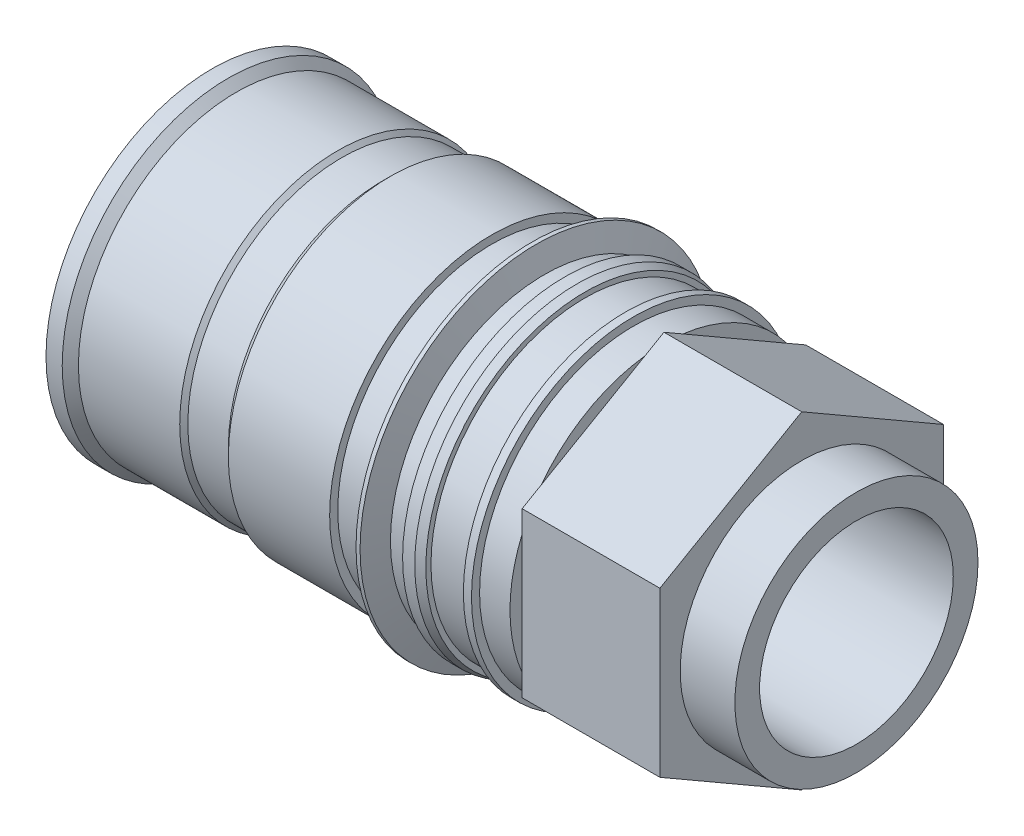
ISO-10303-21;
HEADER;
FILE_DESCRIPTION(('STEP AP214'),'2;1');
FILE_NAME('part.step','',(''),(''),'','','');
FILE_SCHEMA(('AUTOMOTIVE_DESIGN { 1 0 10303 214 1 1 1 1 }'));
ENDSEC;
DATA;
#1=APPLICATION_CONTEXT('core data for automotive mechanical design processes');
#2=APPLICATION_PROTOCOL_DEFINITION('international standard','automotive_design',2000,#1);
#3=PRODUCT_CONTEXT('',#1,'mechanical');
#4=PRODUCT('Part','Part','',(#3));
#5=PRODUCT_RELATED_PRODUCT_CATEGORY('part','',(#4));
#6=PRODUCT_DEFINITION_FORMATION('','',#4);
#7=PRODUCT_DEFINITION_CONTEXT('part definition',#1,'design');
#8=PRODUCT_DEFINITION('design','',#6,#7);
#9=PRODUCT_DEFINITION_SHAPE('','',#8);
#10=(LENGTH_UNIT() NAMED_UNIT(*) SI_UNIT(.MILLI.,.METRE.));
#11=(NAMED_UNIT(*) PLANE_ANGLE_UNIT() SI_UNIT($,.RADIAN.));
#12=(NAMED_UNIT(*) SI_UNIT($,.STERADIAN.) SOLID_ANGLE_UNIT());
#13=UNCERTAINTY_MEASURE_WITH_UNIT(LENGTH_MEASURE(1.E-05),#10,'distance_accuracy_value','');
#14=(GEOMETRIC_REPRESENTATION_CONTEXT(3) GLOBAL_UNCERTAINTY_ASSIGNED_CONTEXT((#13)) GLOBAL_UNIT_ASSIGNED_CONTEXT((#10,
#11,#12)) REPRESENTATION_CONTEXT('',''));
#15=CARTESIAN_POINT('',(0.,0.,0.));
#16=DIRECTION('',(0.,0.,1.));
#17=DIRECTION('',(1.,0.,0.));
#18=AXIS2_PLACEMENT_3D('',#15,#16,#17);
#19=CARTESIAN_POINT('',(111.5,38.,0.));
#20=DIRECTION('',(-1.,0.,0.));
#21=DIRECTION('',(0.,0.,1.));
#22=AXIS2_PLACEMENT_3D('',#19,#20,#21);
#23=PLANE('',#22);
#24=DIRECTION('',(0.,0.5,0.866025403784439));
#25=VECTOR('',#24,1.);
#26=CARTESIAN_POINT('',(111.5,20.2072594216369,-35.));
#27=LINE('',#26,#25);
#28=CARTESIAN_POINT('',(111.5,22.911564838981,-30.3160056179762));
#29=VERTEX_POINT('',#28);
#30=CARTESIAN_POINT('',(111.5,37.7102134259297,-4.68399438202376));
#31=VERTEX_POINT('',#30);
#32=EDGE_CURVE('E41',#29,#31,#27,.T.);
#33=ORIENTED_EDGE('',*,*,#32,.F.);
#34=CARTESIAN_POINT('',(111.5,0.,0.));
#35=DIRECTION('',(-1.,0.,0.));
#36=DIRECTION('',(0.,0.,1.));
#37=AXIS2_PLACEMENT_3D('',#34,#35,#36);
#38=CIRCLE('',#37,38.);
#39=EDGE_CURVE('E296',#31,#29,#38,.T.);
#40=ORIENTED_EDGE('',*,*,#39,.F.);
#41=EDGE_LOOP('',(#33,#40));
#42=FACE_BOUND('',#41,.T.);
#43=ADVANCED_FACE('F32',(#42),#23,.F.);
#44=DIRECTION('',(0.,1.,0.));
#45=VECTOR('',#44,1.);
#46=CARTESIAN_POINT('',(111.5,-20.2072594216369,-35.));
#47=LINE('',#46,#45);
#48=CARTESIAN_POINT('',(111.5,-14.7986485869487,-35.));
#49=VERTEX_POINT('',#48);
#50=CARTESIAN_POINT('',(111.5,14.7986485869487,-35.));
#51=VERTEX_POINT('',#50);
#52=EDGE_CURVE('E242',#49,#51,#47,.T.);
#53=ORIENTED_EDGE('',*,*,#52,.F.);
#54=EDGE_CURVE('E290',#51,#49,#38,.T.);
#55=ORIENTED_EDGE('',*,*,#54,.F.);
#56=EDGE_LOOP('',(#53,#55));
#57=FACE_BOUND('',#56,.T.);
#58=ADVANCED_FACE('F323',(#57),#23,.F.);
#59=DIRECTION('',(0.,0.5,-0.866025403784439));
#60=VECTOR('',#59,1.);
#61=CARTESIAN_POINT('',(111.5,-40.4145188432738,0.));
#62=LINE('',#61,#60);
#63=CARTESIAN_POINT('',(111.5,-37.7102134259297,-4.68399438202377));
#64=VERTEX_POINT('',#63);
#65=CARTESIAN_POINT('',(111.5,-22.911564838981,-30.3160056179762));
#66=VERTEX_POINT('',#65);
#67=EDGE_CURVE('E244',#64,#66,#62,.T.);
#68=ORIENTED_EDGE('',*,*,#67,.F.);
#69=EDGE_CURVE('E284',#66,#64,#38,.T.);
#70=ORIENTED_EDGE('',*,*,#69,.F.);
#71=EDGE_LOOP('',(#68,#70));
#72=FACE_BOUND('',#71,.T.);
#73=ADVANCED_FACE('F330',(#72),#23,.F.);
#74=DIRECTION('',(0.,-0.5,-0.866025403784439));
#75=VECTOR('',#74,1.);
#76=CARTESIAN_POINT('',(111.5,-20.2072594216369,35.));
#77=LINE('',#76,#75);
#78=CARTESIAN_POINT('',(111.5,-22.911564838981,30.3160056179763));
#79=VERTEX_POINT('',#78);
#80=CARTESIAN_POINT('',(111.5,-37.7102134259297,4.68399438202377));
#81=VERTEX_POINT('',#80);
#82=EDGE_CURVE('E55',#79,#81,#77,.T.);
#83=ORIENTED_EDGE('',*,*,#82,.F.);
#84=EDGE_CURVE('E281',#81,#79,#38,.T.);
#85=ORIENTED_EDGE('',*,*,#84,.F.);
#86=EDGE_LOOP('',(#83,#85));
#87=FACE_BOUND('',#86,.T.);
#88=ADVANCED_FACE('F342',(#87),#23,.F.);
#89=DIRECTION('',(0.,-1.,0.));
#90=VECTOR('',#89,1.);
#91=CARTESIAN_POINT('',(111.5,20.2072594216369,35.));
#92=LINE('',#91,#90);
#93=CARTESIAN_POINT('',(111.5,14.7986485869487,35.));
#94=VERTEX_POINT('',#93);
#95=CARTESIAN_POINT('',(111.5,-14.7986485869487,35.));
#96=VERTEX_POINT('',#95);
#97=EDGE_CURVE('E228',#94,#96,#92,.T.);
#98=ORIENTED_EDGE('',*,*,#97,.F.);
#99=EDGE_CURVE('E48',#96,#94,#38,.T.);
#100=ORIENTED_EDGE('',*,*,#99,.F.);
#101=EDGE_LOOP('',(#98,#100));
#102=FACE_BOUND('',#101,.T.);
#103=ADVANCED_FACE('F335',(#102),#23,.F.);
#104=DIRECTION('',(0.,-0.5,0.866025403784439));
#105=VECTOR('',#104,1.);
#106=CARTESIAN_POINT('',(111.5,40.4145188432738,0.));
#107=LINE('',#106,#105);
#108=CARTESIAN_POINT('',(111.5,37.7102134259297,4.68399438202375));
#109=VERTEX_POINT('',#108);
#110=CARTESIAN_POINT('',(111.5,22.911564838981,30.3160056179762));
#111=VERTEX_POINT('',#110);
#112=EDGE_CURVE('E224',#109,#111,#107,.T.);
#113=ORIENTED_EDGE('',*,*,#112,.F.);
#114=EDGE_CURVE('E160',#111,#109,#38,.T.);
#115=ORIENTED_EDGE('',*,*,#114,.F.);
#116=EDGE_LOOP('',(#113,#115));
#117=FACE_BOUND('',#116,.T.);
#118=ADVANCED_FACE('F326',(#117),#23,.F.);
#119=CARTESIAN_POINT('',(0.,0.,0.));
#120=DIRECTION('',(1.,0.,0.));
#121=DIRECTION('',(0.,0.,-1.));
#122=AXIS2_PLACEMENT_3D('',#119,#120,#121);
#123=PLANE('',#122);
#124=CARTESIAN_POINT('',(0.,0.,0.));
#125=DIRECTION('',(1.,0.,0.));
#126=DIRECTION('',(0.,0.,-1.));
#127=AXIS2_PLACEMENT_3D('',#124,#125,#126);
#128=CIRCLE('',#127,23.9);
#129=CARTESIAN_POINT('',(0.,0.,-23.9));
#130=VERTEX_POINT('',#129);
#131=EDGE_CURVE('E397',#130,#130,#128,.T.);
#132=ORIENTED_EDGE('',*,*,#131,.T.);
#133=EDGE_LOOP('',(#132));
#134=FACE_BOUND('',#133,.T.);
#135=CARTESIAN_POINT('',(0.,0.,0.));
#136=DIRECTION('',(-1.,0.,0.));
#137=DIRECTION('',(0.,0.,1.));
#138=AXIS2_PLACEMENT_3D('',#135,#136,#137);
#139=CIRCLE('',#138,41.);
#140=CARTESIAN_POINT('',(0.,0.,41.));
#141=VERTEX_POINT('',#140);
#142=EDGE_CURVE('E36',#141,#141,#139,.T.);
#143=ORIENTED_EDGE('',*,*,#142,.T.);
#144=EDGE_LOOP('',(#143));
#145=FACE_BOUND('',#144,.T.);
#146=ADVANCED_FACE('F34',(#134,#145),#123,.F.);
#147=CARTESIAN_POINT('',(0.,0.,0.));
#148=DIRECTION('',(-1.,0.,0.));
#149=DIRECTION('',(0.,0.,1.));
#150=AXIS2_PLACEMENT_3D('',#147,#148,#149);
#151=CYLINDRICAL_SURFACE('',#150,41.);
#152=ORIENTED_EDGE('',*,*,#142,.F.);
#153=EDGE_LOOP('',(#152));
#154=FACE_BOUND('',#153,.T.);
#155=CARTESIAN_POINT('',(4.,0.,0.));
#156=DIRECTION('',(-1.,0.,0.));
#157=DIRECTION('',(0.,0.,1.));
#158=AXIS2_PLACEMENT_3D('',#155,#156,#157);
#159=CIRCLE('',#158,41.);
#160=CARTESIAN_POINT('',(4.,0.,41.));
#161=VERTEX_POINT('',#160);
#162=EDGE_CURVE('E219',#161,#161,#159,.T.);
#163=ORIENTED_EDGE('',*,*,#162,.T.);
#164=EDGE_LOOP('',(#163));
#165=FACE_BOUND('',#164,.T.);
#166=ADVANCED_FACE('F340',(#154,#165),#151,.T.);
#167=CARTESIAN_POINT('',(6.,0.,0.));
#168=DIRECTION('',(-1.,0.,0.));
#169=DIRECTION('',(0.,0.,1.));
#170=AXIS2_PLACEMENT_3D('',#167,#168,#169);
#171=CONICAL_SURFACE('',#170,39.,0.78539816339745);
#172=ORIENTED_EDGE('',*,*,#162,.F.);
#173=EDGE_LOOP('',(#172));
#174=FACE_BOUND('',#173,.T.);
#175=CARTESIAN_POINT('',(6.,0.,0.));
#176=DIRECTION('',(-1.,0.,0.));
#177=DIRECTION('',(0.,0.,1.));
#178=AXIS2_PLACEMENT_3D('',#175,#176,#177);
#179=CIRCLE('',#178,39.);
#180=CARTESIAN_POINT('',(6.,0.,39.));
#181=VERTEX_POINT('',#180);
#182=EDGE_CURVE('E217',#181,#181,#179,.T.);
#183=ORIENTED_EDGE('',*,*,#182,.T.);
#184=EDGE_LOOP('',(#183));
#185=FACE_BOUND('',#184,.T.);
#186=ADVANCED_FACE('F439',(#174,#185),#171,.T.);
#187=CARTESIAN_POINT('',(0.,0.,0.));
#188=DIRECTION('',(-1.,0.,0.));
#189=DIRECTION('',(0.,0.,1.));
#190=AXIS2_PLACEMENT_3D('',#187,#188,#189);
#191=CYLINDRICAL_SURFACE('',#190,39.);
#192=ORIENTED_EDGE('',*,*,#182,.F.);
#193=EDGE_LOOP('',(#192));
#194=FACE_BOUND('',#193,.T.);
#195=CARTESIAN_POINT('',(31.,0.,0.));
#196=DIRECTION('',(-1.,0.,0.));
#197=DIRECTION('',(0.,0.,1.));
#198=AXIS2_PLACEMENT_3D('',#195,#196,#197);
#199=CIRCLE('',#198,39.);
#200=CARTESIAN_POINT('',(31.,0.,39.));
#201=VERTEX_POINT('',#200);
#202=EDGE_CURVE('E214',#201,#201,#199,.T.);
#203=ORIENTED_EDGE('',*,*,#202,.T.);
#204=EDGE_LOOP('',(#203));
#205=FACE_BOUND('',#204,.T.);
#206=ADVANCED_FACE('F445',(#194,#205),#191,.T.);
#207=CARTESIAN_POINT('',(32.,0.,0.));
#208=DIRECTION('',(-1.,0.,0.));
#209=DIRECTION('',(0.,0.,1.));
#210=AXIS2_PLACEMENT_3D('',#207,#208,#209);
#211=CONICAL_SURFACE('',#210,38.,0.785398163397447);
#212=ORIENTED_EDGE('',*,*,#202,.F.);
#213=EDGE_LOOP('',(#212));
#214=FACE_BOUND('',#213,.T.);
#215=CARTESIAN_POINT('',(32.,0.,0.));
#216=DIRECTION('',(-1.,0.,0.));
#217=DIRECTION('',(0.,0.,1.));
#218=AXIS2_PLACEMENT_3D('',#215,#216,#217);
#219=CIRCLE('',#218,38.);
#220=CARTESIAN_POINT('',(32.,0.,38.));
#221=VERTEX_POINT('',#220);
#222=EDGE_CURVE('E211',#221,#221,#219,.T.);
#223=ORIENTED_EDGE('',*,*,#222,.T.);
#224=EDGE_LOOP('',(#223));
#225=FACE_BOUND('',#224,.T.);
#226=ADVANCED_FACE('F453',(#214,#225),#211,.T.);
#227=CARTESIAN_POINT('',(0.,0.,0.));
#228=DIRECTION('',(-1.,0.,0.));
#229=DIRECTION('',(0.,0.,1.));
#230=AXIS2_PLACEMENT_3D('',#227,#228,#229);
#231=CYLINDRICAL_SURFACE('',#230,38.);
#232=ORIENTED_EDGE('',*,*,#222,.F.);
#233=EDGE_LOOP('',(#232));
#234=FACE_BOUND('',#233,.T.);
#235=CARTESIAN_POINT('',(42.,0.,0.));
#236=DIRECTION('',(-1.,0.,0.));
#237=DIRECTION('',(0.,0.,1.));
#238=AXIS2_PLACEMENT_3D('',#235,#236,#237);
#239=CIRCLE('',#238,38.);
#240=CARTESIAN_POINT('',(42.,0.,38.));
#241=VERTEX_POINT('',#240);
#242=EDGE_CURVE('E208',#241,#241,#239,.T.);
#243=ORIENTED_EDGE('',*,*,#242,.T.);
#244=EDGE_LOOP('',(#243));
#245=FACE_BOUND('',#244,.T.);
#246=ADVANCED_FACE('F461',(#234,#245),#231,.T.);
#247=CARTESIAN_POINT('',(44.,0.,0.));
#248=DIRECTION('',(1.,0.,0.));
#249=DIRECTION('',(0.,0.,-1.));
#250=AXIS2_PLACEMENT_3D('',#247,#248,#249);
#251=CONICAL_SURFACE('',#250,40.,0.785398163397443);
#252=ORIENTED_EDGE('',*,*,#242,.F.);
#253=EDGE_LOOP('',(#252));
#254=FACE_BOUND('',#253,.T.);
#255=CARTESIAN_POINT('',(44.,0.,0.));
#256=DIRECTION('',(-1.,0.,0.));
#257=DIRECTION('',(0.,0.,1.));
#258=AXIS2_PLACEMENT_3D('',#255,#256,#257);
#259=CIRCLE('',#258,40.);
#260=CARTESIAN_POINT('',(44.,0.,40.));
#261=VERTEX_POINT('',#260);
#262=EDGE_CURVE('E205',#261,#261,#259,.T.);
#263=ORIENTED_EDGE('',*,*,#262,.T.);
#264=EDGE_LOOP('',(#263));
#265=FACE_BOUND('',#264,.T.);
#266=ADVANCED_FACE('F469',(#254,#265),#251,.T.);
#267=CARTESIAN_POINT('',(0.,0.,0.));
#268=DIRECTION('',(-1.,0.,0.));
#269=DIRECTION('',(0.,0.,1.));
#270=AXIS2_PLACEMENT_3D('',#267,#268,#269);
#271=CYLINDRICAL_SURFACE('',#270,40.);
#272=ORIENTED_EDGE('',*,*,#262,.F.);
#273=EDGE_LOOP('',(#272));
#274=FACE_BOUND('',#273,.T.);
#275=CARTESIAN_POINT('',(69.,0.,0.));
#276=DIRECTION('',(-1.,0.,0.));
#277=DIRECTION('',(0.,0.,1.));
#278=AXIS2_PLACEMENT_3D('',#275,#276,#277);
#279=CIRCLE('',#278,40.);
#280=CARTESIAN_POINT('',(69.,0.,40.));
#281=VERTEX_POINT('',#280);
#282=EDGE_CURVE('E202',#281,#281,#279,.T.);
#283=ORIENTED_EDGE('',*,*,#282,.T.);
#284=EDGE_LOOP('',(#283));
#285=FACE_BOUND('',#284,.T.);
#286=ADVANCED_FACE('F477',(#274,#285),#271,.T.);
#287=CARTESIAN_POINT('',(69.,40.,0.));
#288=DIRECTION('',(-1.,0.,0.));
#289=DIRECTION('',(0.,0.,1.));
#290=AXIS2_PLACEMENT_3D('',#287,#288,#289);
#291=PLANE('',#290);
#292=ORIENTED_EDGE('',*,*,#282,.F.);
#293=EDGE_LOOP('',(#292));
#294=FACE_BOUND('',#293,.T.);
#295=CARTESIAN_POINT('',(69.,0.,0.));
#296=DIRECTION('',(-1.,0.,0.));
#297=DIRECTION('',(0.,0.,1.));
#298=AXIS2_PLACEMENT_3D('',#295,#296,#297);
#299=CIRCLE('',#298,38.);
#300=CARTESIAN_POINT('',(69.,0.,38.));
#301=VERTEX_POINT('',#300);
#302=EDGE_CURVE('E199',#301,#301,#299,.T.);
#303=ORIENTED_EDGE('',*,*,#302,.T.);
#304=EDGE_LOOP('',(#303));
#305=FACE_BOUND('',#304,.T.);
#306=ADVANCED_FACE('F485',(#294,#305),#291,.F.);
#307=CARTESIAN_POINT('',(0.,0.,0.));
#308=DIRECTION('',(-1.,0.,0.));
#309=DIRECTION('',(0.,0.,1.));
#310=AXIS2_PLACEMENT_3D('',#307,#308,#309);
#311=CYLINDRICAL_SURFACE('',#310,38.);
#312=ORIENTED_EDGE('',*,*,#302,.F.);
#313=EDGE_LOOP('',(#312));
#314=FACE_BOUND('',#313,.T.);
#315=CARTESIAN_POINT('',(77.,0.,0.));
#316=DIRECTION('',(-1.,0.,0.));
#317=DIRECTION('',(0.,0.,1.));
#318=AXIS2_PLACEMENT_3D('',#315,#316,#317);
#319=CIRCLE('',#318,38.);
#320=CARTESIAN_POINT('',(77.,0.,38.));
#321=VERTEX_POINT('',#320);
#322=EDGE_CURVE('E196',#321,#321,#319,.T.);
#323=ORIENTED_EDGE('',*,*,#322,.T.);
#324=EDGE_LOOP('',(#323));
#325=FACE_BOUND('',#324,.T.);
#326=ADVANCED_FACE('F493',(#314,#325),#311,.T.);
#327=CARTESIAN_POINT('',(79.,0.,0.));
#328=DIRECTION('',(1.,0.,0.));
#329=DIRECTION('',(0.,0.,-1.));
#330=AXIS2_PLACEMENT_3D('',#327,#328,#329);
#331=CONICAL_SURFACE('',#330,43.4949548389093,1.22173047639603);
#332=ORIENTED_EDGE('',*,*,#322,.F.);
#333=EDGE_LOOP('',(#332));
#334=FACE_BOUND('',#333,.T.);
#335=CARTESIAN_POINT('',(79.,0.,0.));
#336=DIRECTION('',(-1.,0.,0.));
#337=DIRECTION('',(0.,0.,1.));
#338=AXIS2_PLACEMENT_3D('',#335,#336,#337);
#339=CIRCLE('',#338,43.4949548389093);
#340=CARTESIAN_POINT('',(79.,0.,43.4949548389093));
#341=VERTEX_POINT('',#340);
#342=EDGE_CURVE('E193',#341,#341,#339,.T.);
#343=ORIENTED_EDGE('',*,*,#342,.T.);
#344=EDGE_LOOP('',(#343));
#345=FACE_BOUND('',#344,.T.);
#346=ADVANCED_FACE('F501',(#334,#345),#331,.T.);
#347=CARTESIAN_POINT('',(0.,0.,0.));
#348=DIRECTION('',(-1.,0.,0.));
#349=DIRECTION('',(0.,0.,1.));
#350=AXIS2_PLACEMENT_3D('',#347,#348,#349);
#351=CYLINDRICAL_SURFACE('',#350,43.4949548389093);
#352=ORIENTED_EDGE('',*,*,#342,.F.);
#353=EDGE_LOOP('',(#352));
#354=FACE_BOUND('',#353,.T.);
#355=CARTESIAN_POINT('',(80.,0.,0.));
#356=DIRECTION('',(-1.,0.,0.));
#357=DIRECTION('',(0.,0.,1.));
#358=AXIS2_PLACEMENT_3D('',#355,#356,#357);
#359=CIRCLE('',#358,43.4949548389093);
#360=CARTESIAN_POINT('',(80.,0.,43.4949548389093));
#361=VERTEX_POINT('',#360);
#362=EDGE_CURVE('E190',#361,#361,#359,.T.);
#363=ORIENTED_EDGE('',*,*,#362,.T.);
#364=EDGE_LOOP('',(#363));
#365=FACE_BOUND('',#364,.T.);
#366=ADVANCED_FACE('F509',(#354,#365),#351,.T.);
#367=CARTESIAN_POINT('',(82.,0.,0.));
#368=DIRECTION('',(-1.,0.,0.));
#369=DIRECTION('',(0.,0.,1.));
#370=AXIS2_PLACEMENT_3D('',#367,#368,#369);
#371=CONICAL_SURFACE('',#370,38.,1.22173047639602);
#372=ORIENTED_EDGE('',*,*,#362,.F.);
#373=EDGE_LOOP('',(#372));
#374=FACE_BOUND('',#373,.T.);
#375=CARTESIAN_POINT('',(82.,0.,0.));
#376=DIRECTION('',(-1.,0.,0.));
#377=DIRECTION('',(0.,0.,1.));
#378=AXIS2_PLACEMENT_3D('',#375,#376,#377);
#379=CIRCLE('',#378,38.);
#380=CARTESIAN_POINT('',(82.,0.,38.));
#381=VERTEX_POINT('',#380);
#382=EDGE_CURVE('E187',#381,#381,#379,.T.);
#383=ORIENTED_EDGE('',*,*,#382,.T.);
#384=EDGE_LOOP('',(#383));
#385=FACE_BOUND('',#384,.T.);
#386=ADVANCED_FACE('F517',(#374,#385),#371,.T.);
#387=CARTESIAN_POINT('',(0.,0.,0.));
#388=DIRECTION('',(-1.,0.,0.));
#389=DIRECTION('',(0.,0.,1.));
#390=AXIS2_PLACEMENT_3D('',#387,#388,#389);
#391=CYLINDRICAL_SURFACE('',#390,38.);
#392=ORIENTED_EDGE('',*,*,#382,.F.);
#393=EDGE_LOOP('',(#392));
#394=FACE_BOUND('',#393,.T.);
#395=CARTESIAN_POINT('',(87.,0.,0.));
#396=DIRECTION('',(-1.,0.,0.));
#397=DIRECTION('',(0.,0.,1.));
#398=AXIS2_PLACEMENT_3D('',#395,#396,#397);
#399=CIRCLE('',#398,38.);
#400=CARTESIAN_POINT('',(87.,0.,38.));
#401=VERTEX_POINT('',#400);
#402=EDGE_CURVE('E184',#401,#401,#399,.T.);
#403=ORIENTED_EDGE('',*,*,#402,.T.);
#404=EDGE_LOOP('',(#403));
#405=FACE_BOUND('',#404,.T.);
#406=ADVANCED_FACE('F525',(#394,#405),#391,.T.);
#407=CARTESIAN_POINT('',(87.,38.,0.));
#408=DIRECTION('',(1.,0.,0.));
#409=DIRECTION('',(0.,0.,-1.));
#410=AXIS2_PLACEMENT_3D('',#407,#408,#409);
#411=PLANE('',#410);
#412=ORIENTED_EDGE('',*,*,#402,.F.);
#413=EDGE_LOOP('',(#412));
#414=FACE_BOUND('',#413,.T.);
#415=CARTESIAN_POINT('',(87.,0.,0.));
#416=DIRECTION('',(-1.,0.,0.));
#417=DIRECTION('',(0.,0.,1.));
#418=AXIS2_PLACEMENT_3D('',#415,#416,#417);
#419=CIRCLE('',#418,40.);
#420=CARTESIAN_POINT('',(87.,0.,40.));
#421=VERTEX_POINT('',#420);
#422=EDGE_CURVE('E181',#421,#421,#419,.T.);
#423=ORIENTED_EDGE('',*,*,#422,.T.);
#424=EDGE_LOOP('',(#423));
#425=FACE_BOUND('',#424,.T.);
#426=ADVANCED_FACE('F533',(#414,#425),#411,.F.);
#427=CARTESIAN_POINT('',(0.,0.,0.));
#428=DIRECTION('',(-1.,0.,0.));
#429=DIRECTION('',(0.,0.,1.));
#430=AXIS2_PLACEMENT_3D('',#427,#428,#429);
#431=CYLINDRICAL_SURFACE('',#430,40.);
#432=ORIENTED_EDGE('',*,*,#422,.F.);
#433=EDGE_LOOP('',(#432));
#434=FACE_BOUND('',#433,.T.);
#435=CARTESIAN_POINT('',(90.0000000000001,0.,0.));
#436=DIRECTION('',(-1.,0.,0.));
#437=DIRECTION('',(0.,0.,1.));
#438=AXIS2_PLACEMENT_3D('',#435,#436,#437);
#439=CIRCLE('',#438,40.);
#440=CARTESIAN_POINT('',(90.0000000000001,0.,40.));
#441=VERTEX_POINT('',#440);
#442=EDGE_CURVE('E178',#441,#441,#439,.T.);
#443=ORIENTED_EDGE('',*,*,#442,.T.);
#444=EDGE_LOOP('',(#443));
#445=FACE_BOUND('',#444,.T.);
#446=ADVANCED_FACE('F541',(#434,#445),#431,.T.);
#447=CARTESIAN_POINT('',(92.0000000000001,0.,0.));
#448=DIRECTION('',(-1.,0.,0.));
#449=DIRECTION('',(0.,0.,1.));
#450=AXIS2_PLACEMENT_3D('',#447,#448,#449);
#451=CONICAL_SURFACE('',#450,39.2720595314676,0.349065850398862);
#452=ORIENTED_EDGE('',*,*,#442,.F.);
#453=EDGE_LOOP('',(#452));
#454=FACE_BOUND('',#453,.T.);
#455=CARTESIAN_POINT('',(92.0000000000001,0.,0.));
#456=DIRECTION('',(-1.,0.,0.));
#457=DIRECTION('',(0.,0.,1.));
#458=AXIS2_PLACEMENT_3D('',#455,#456,#457);
#459=CIRCLE('',#458,39.2720595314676);
#460=CARTESIAN_POINT('',(92.0000000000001,0.,39.2720595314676));
#461=VERTEX_POINT('',#460);
#462=EDGE_CURVE('E175',#461,#461,#459,.T.);
#463=ORIENTED_EDGE('',*,*,#462,.T.);
#464=EDGE_LOOP('',(#463));
#465=FACE_BOUND('',#464,.T.);
#466=ADVANCED_FACE('F549',(#454,#465),#451,.T.);
#467=CARTESIAN_POINT('',(92.0000000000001,39.2720595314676,0.));
#468=DIRECTION('',(-1.,0.,0.));
#469=DIRECTION('',(0.,0.,1.));
#470=AXIS2_PLACEMENT_3D('',#467,#468,#469);
#471=PLANE('',#470);
#472=ORIENTED_EDGE('',*,*,#462,.F.);
#473=EDGE_LOOP('',(#472));
#474=FACE_BOUND('',#473,.T.);
#475=CARTESIAN_POINT('',(92.0000000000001,0.,0.));
#476=DIRECTION('',(-1.,0.,0.));
#477=DIRECTION('',(0.,0.,1.));
#478=AXIS2_PLACEMENT_3D('',#475,#476,#477);
#479=CIRCLE('',#478,38.);
#480=CARTESIAN_POINT('',(92.0000000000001,0.,38.));
#481=VERTEX_POINT('',#480);
#482=EDGE_CURVE('E172',#481,#481,#479,.T.);
#483=ORIENTED_EDGE('',*,*,#482,.T.);
#484=EDGE_LOOP('',(#483));
#485=FACE_BOUND('',#484,.T.);
#486=ADVANCED_FACE('F557',(#474,#485),#471,.F.);
#487=CARTESIAN_POINT('',(0.,0.,0.));
#488=DIRECTION('',(-1.,0.,0.));
#489=DIRECTION('',(0.,0.,1.));
#490=AXIS2_PLACEMENT_3D('',#487,#488,#489);
#491=CYLINDRICAL_SURFACE('',#490,38.);
#492=ORIENTED_EDGE('',*,*,#482,.F.);
#493=EDGE_LOOP('',(#492));
#494=FACE_BOUND('',#493,.T.);
#495=CARTESIAN_POINT('',(102.,0.,0.));
#496=DIRECTION('',(-1.,0.,0.));
#497=DIRECTION('',(0.,0.,1.));
#498=AXIS2_PLACEMENT_3D('',#495,#496,#497);
#499=CIRCLE('',#498,38.);
#500=CARTESIAN_POINT('',(102.,0.,38.));
#501=VERTEX_POINT('',#500);
#502=EDGE_CURVE('E169',#501,#501,#499,.T.);
#503=ORIENTED_EDGE('',*,*,#502,.T.);
#504=EDGE_LOOP('',(#503));
#505=FACE_BOUND('',#504,.T.);
#506=ADVANCED_FACE('F565',(#494,#505),#491,.T.);
#507=CARTESIAN_POINT('',(102.,38.,0.));
#508=DIRECTION('',(1.,0.,0.));
#509=DIRECTION('',(0.,0.,-1.));
#510=AXIS2_PLACEMENT_3D('',#507,#508,#509);
#511=PLANE('',#510);
#512=ORIENTED_EDGE('',*,*,#502,.F.);
#513=EDGE_LOOP('',(#512));
#514=FACE_BOUND('',#513,.T.);
#515=CARTESIAN_POINT('',(102.,0.,0.));
#516=DIRECTION('',(-1.,0.,0.));
#517=DIRECTION('',(0.,0.,1.));
#518=AXIS2_PLACEMENT_3D('',#515,#516,#517);
#519=CIRCLE('',#518,40.);
#520=CARTESIAN_POINT('',(102.,0.,40.));
#521=VERTEX_POINT('',#520);
#522=EDGE_CURVE('E166',#521,#521,#519,.T.);
#523=ORIENTED_EDGE('',*,*,#522,.T.);
#524=EDGE_LOOP('',(#523));
#525=FACE_BOUND('',#524,.T.);
#526=ADVANCED_FACE('F573',(#514,#525),#511,.F.);
#527=CARTESIAN_POINT('',(0.,0.,0.));
#528=DIRECTION('',(-1.,0.,0.));
#529=DIRECTION('',(0.,0.,1.));
#530=AXIS2_PLACEMENT_3D('',#527,#528,#529);
#531=CYLINDRICAL_SURFACE('',#530,40.);
#532=ORIENTED_EDGE('',*,*,#522,.F.);
#533=EDGE_LOOP('',(#532));
#534=FACE_BOUND('',#533,.T.);
#535=CARTESIAN_POINT('',(104.,0.,0.));
#536=DIRECTION('',(-1.,0.,0.));
#537=DIRECTION('',(0.,0.,1.));
#538=AXIS2_PLACEMENT_3D('',#535,#536,#537);
#539=CIRCLE('',#538,40.);
#540=CARTESIAN_POINT('',(104.,0.,40.));
#541=VERTEX_POINT('',#540);
#542=EDGE_CURVE('E163',#541,#541,#539,.T.);
#543=ORIENTED_EDGE('',*,*,#542,.T.);
#544=EDGE_LOOP('',(#543));
#545=FACE_BOUND('',#544,.T.);
#546=ADVANCED_FACE('F581',(#534,#545),#531,.T.);
#547=CARTESIAN_POINT('',(104.,40.,0.));
#548=DIRECTION('',(-1.,0.,0.));
#549=DIRECTION('',(0.,0.,1.));
#550=AXIS2_PLACEMENT_3D('',#547,#548,#549);
#551=PLANE('',#550);
#552=ORIENTED_EDGE('',*,*,#542,.F.);
#553=EDGE_LOOP('',(#552));
#554=FACE_BOUND('',#553,.T.);
#555=CARTESIAN_POINT('',(104.,0.,0.));
#556=DIRECTION('',(-1.,0.,0.));
#557=DIRECTION('',(0.,0.,1.));
#558=AXIS2_PLACEMENT_3D('',#555,#556,#557);
#559=CIRCLE('',#558,38.);
#560=CARTESIAN_POINT('',(104.,0.,38.));
#561=VERTEX_POINT('',#560);
#562=EDGE_CURVE('E159',#561,#561,#559,.T.);
#563=ORIENTED_EDGE('',*,*,#562,.T.);
#564=EDGE_LOOP('',(#563));
#565=FACE_BOUND('',#564,.T.);
#566=ADVANCED_FACE('F589',(#554,#565),#551,.F.);
#567=CARTESIAN_POINT('',(0.,0.,0.));
#568=DIRECTION('',(-1.,0.,0.));
#569=DIRECTION('',(0.,0.,1.));
#570=AXIS2_PLACEMENT_3D('',#567,#568,#569);
#571=CYLINDRICAL_SURFACE('',#570,38.);
#572=ORIENTED_EDGE('',*,*,#562,.F.);
#573=EDGE_LOOP('',(#572));
#574=FACE_BOUND('',#573,.T.);
#575=EDGE_CURVE('E154',#94,#111,#38,.T.);
#576=ORIENTED_EDGE('',*,*,#575,.T.);
#577=ORIENTED_EDGE('',*,*,#114,.T.);
#578=EDGE_CURVE('E299',#109,#31,#38,.T.);
#579=ORIENTED_EDGE('',*,*,#578,.T.);
#580=ORIENTED_EDGE('',*,*,#39,.T.);
#581=EDGE_CURVE('E294',#29,#51,#38,.T.);
#582=ORIENTED_EDGE('',*,*,#581,.T.);
#583=ORIENTED_EDGE('',*,*,#54,.T.);
#584=EDGE_CURVE('E288',#49,#66,#38,.T.);
#585=ORIENTED_EDGE('',*,*,#584,.T.);
#586=ORIENTED_EDGE('',*,*,#69,.T.);
#587=EDGE_CURVE('E282',#64,#81,#38,.T.);
#588=ORIENTED_EDGE('',*,*,#587,.T.);
#589=ORIENTED_EDGE('',*,*,#84,.T.);
#590=EDGE_CURVE('E152',#79,#96,#38,.T.);
#591=ORIENTED_EDGE('',*,*,#590,.T.);
#592=ORIENTED_EDGE('',*,*,#99,.T.);
#593=EDGE_LOOP('',(#576,#577,#579,#580,#582,#583,#585,#586,#588,#589,#591,#592));
#594=FACE_BOUND('',#593,.T.);
#595=ADVANCED_FACE('F304',(#574,#594),#571,.T.);
#596=CARTESIAN_POINT('',(111.5,0.,0.));
#597=DIRECTION('',(1.,0.,0.));
#598=DIRECTION('',(0.,0.,-1.));
#599=AXIS2_PLACEMENT_3D('',#596,#597,#598);
#600=PLANE('',#599);
#601=ORIENTED_EDGE('',*,*,#575,.F.);
#602=CARTESIAN_POINT('',(111.5,20.2072594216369,35.));
#603=VERTEX_POINT('',#602);
#604=EDGE_CURVE('E234',#603,#94,#92,.T.);
#605=ORIENTED_EDGE('',*,*,#604,.F.);
#606=EDGE_CURVE('E231',#111,#603,#107,.T.);
#607=ORIENTED_EDGE('',*,*,#606,.F.);
#608=EDGE_LOOP('',(#601,#605,#607));
#609=FACE_BOUND('',#608,.T.);
#610=ADVANCED_FACE('F311',(#609),#600,.F.);
#611=ORIENTED_EDGE('',*,*,#578,.F.);
#612=CARTESIAN_POINT('',(111.5,40.4145188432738,0.));
#613=VERTEX_POINT('',#612);
#614=EDGE_CURVE('E230',#613,#109,#107,.T.);
#615=ORIENTED_EDGE('',*,*,#614,.F.);
#616=EDGE_CURVE('E149',#31,#613,#27,.T.);
#617=ORIENTED_EDGE('',*,*,#616,.F.);
#618=EDGE_LOOP('',(#611,#615,#617));
#619=FACE_BOUND('',#618,.T.);
#620=ADVANCED_FACE('F308',(#619),#600,.F.);
#621=ORIENTED_EDGE('',*,*,#581,.F.);
#622=CARTESIAN_POINT('',(111.5,20.2072594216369,-35.));
#623=VERTEX_POINT('',#622);
#624=EDGE_CURVE('E237',#623,#29,#27,.T.);
#625=ORIENTED_EDGE('',*,*,#624,.F.);
#626=EDGE_CURVE('E246',#51,#623,#47,.T.);
#627=ORIENTED_EDGE('',*,*,#626,.F.);
#628=EDGE_LOOP('',(#621,#625,#627));
#629=FACE_BOUND('',#628,.T.);
#630=ADVANCED_FACE('F310',(#629),#600,.F.);
#631=ORIENTED_EDGE('',*,*,#584,.F.);
#632=CARTESIAN_POINT('',(111.5,-20.2072594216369,-35.));
#633=VERTEX_POINT('',#632);
#634=EDGE_CURVE('E143',#633,#49,#47,.T.);
#635=ORIENTED_EDGE('',*,*,#634,.F.);
#636=EDGE_CURVE('E252',#66,#633,#62,.T.);
#637=ORIENTED_EDGE('',*,*,#636,.F.);
#638=EDGE_LOOP('',(#631,#635,#637));
#639=FACE_BOUND('',#638,.T.);
#640=ADVANCED_FACE('F317',(#639),#600,.F.);
#641=ORIENTED_EDGE('',*,*,#587,.F.);
#642=CARTESIAN_POINT('',(111.5,-40.4145188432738,0.));
#643=VERTEX_POINT('',#642);
#644=EDGE_CURVE('E251',#643,#64,#62,.T.);
#645=ORIENTED_EDGE('',*,*,#644,.F.);
#646=EDGE_CURVE('E262',#81,#643,#77,.T.);
#647=ORIENTED_EDGE('',*,*,#646,.F.);
#648=EDGE_LOOP('',(#641,#645,#647));
#649=FACE_BOUND('',#648,.T.);
#650=ADVANCED_FACE('F363',(#649),#600,.F.);
#651=CARTESIAN_POINT('',(145.5,20.2072594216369,-35.));
#652=DIRECTION('',(0.,-0.866025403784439,0.5));
#653=DIRECTION('',(0.,-0.5,-0.866025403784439));
#654=AXIS2_PLACEMENT_3D('',#651,#652,#653);
#655=PLANE('',#654);
#656=ORIENTED_EDGE('',*,*,#624,.T.);
#657=ORIENTED_EDGE('',*,*,#32,.T.);
#658=ORIENTED_EDGE('',*,*,#616,.T.);
#659=DIRECTION('',(-1.,0.,0.));
#660=VECTOR('',#659,1.);
#661=CARTESIAN_POINT('',(145.5,40.4145188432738,0.));
#662=LINE('',#661,#660);
#663=CARTESIAN_POINT('',(145.5,40.4145188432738,0.));
#664=VERTEX_POINT('',#663);
#665=EDGE_CURVE('E128',#664,#613,#662,.T.);
#666=ORIENTED_EDGE('',*,*,#665,.F.);
#667=DIRECTION('',(0.,0.5,0.866025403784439));
#668=VECTOR('',#667,1.);
#669=CARTESIAN_POINT('',(145.5,20.2072594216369,-35.));
#670=LINE('',#669,#668);
#671=CARTESIAN_POINT('',(145.5,20.2072594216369,-35.));
#672=VERTEX_POINT('',#671);
#673=EDGE_CURVE('E134',#672,#664,#670,.T.);
#674=ORIENTED_EDGE('',*,*,#673,.F.);
#675=DIRECTION('',(-1.,0.,0.));
#676=VECTOR('',#675,1.);
#677=CARTESIAN_POINT('',(145.5,20.2072594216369,-35.));
#678=LINE('',#677,#676);
#679=EDGE_CURVE('E360',#672,#623,#678,.T.);
#680=ORIENTED_EDGE('',*,*,#679,.T.);
#681=EDGE_LOOP('',(#656,#657,#658,#666,#674,#680));
#682=FACE_BOUND('',#681,.T.);
#683=ADVANCED_FACE('F146',(#682),#655,.F.);
#684=CARTESIAN_POINT('',(145.5,40.4145188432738,0.));
#685=DIRECTION('',(0.,-0.866025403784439,-0.5));
#686=DIRECTION('',(0.,0.5,-0.866025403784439));
#687=AXIS2_PLACEMENT_3D('',#684,#685,#686);
#688=PLANE('',#687);
#689=ORIENTED_EDGE('',*,*,#614,.T.);
#690=ORIENTED_EDGE('',*,*,#112,.T.);
#691=ORIENTED_EDGE('',*,*,#606,.T.);
#692=DIRECTION('',(-1.,0.,0.));
#693=VECTOR('',#692,1.);
#694=CARTESIAN_POINT('',(145.5,20.2072594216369,35.));
#695=LINE('',#694,#693);
#696=CARTESIAN_POINT('',(145.5,20.2072594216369,35.));
#697=VERTEX_POINT('',#696);
#698=EDGE_CURVE('E130',#697,#603,#695,.T.);
#699=ORIENTED_EDGE('',*,*,#698,.F.);
#700=DIRECTION('',(0.,-0.5,0.866025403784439));
#701=VECTOR('',#700,1.);
#702=CARTESIAN_POINT('',(145.5,40.4145188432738,0.));
#703=LINE('',#702,#701);
#704=EDGE_CURVE('E123',#664,#697,#703,.T.);
#705=ORIENTED_EDGE('',*,*,#704,.F.);
#706=ORIENTED_EDGE('',*,*,#665,.T.);
#707=EDGE_LOOP('',(#689,#690,#691,#699,#705,#706));
#708=FACE_BOUND('',#707,.T.);
#709=ADVANCED_FACE('F126',(#708),#688,.F.);
#710=CARTESIAN_POINT('',(145.5,20.2072594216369,35.));
#711=DIRECTION('',(0.,0.,-1.));
#712=DIRECTION('',(-1.,0.,0.));
#713=AXIS2_PLACEMENT_3D('',#710,#711,#712);
#714=PLANE('',#713);
#715=ORIENTED_EDGE('',*,*,#604,.T.);
#716=ORIENTED_EDGE('',*,*,#97,.T.);
#717=CARTESIAN_POINT('',(111.5,-20.2072594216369,35.));
#718=VERTEX_POINT('',#717);
#719=EDGE_CURVE('E235',#96,#718,#92,.T.);
#720=ORIENTED_EDGE('',*,*,#719,.T.);
#721=DIRECTION('',(-1.,0.,0.));
#722=VECTOR('',#721,1.);
#723=CARTESIAN_POINT('',(145.5,-20.2072594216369,35.));
#724=LINE('',#723,#722);
#725=CARTESIAN_POINT('',(145.5,-20.2072594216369,35.));
#726=VERTEX_POINT('',#725);
#727=EDGE_CURVE('E155',#726,#718,#724,.T.);
#728=ORIENTED_EDGE('',*,*,#727,.F.);
#729=DIRECTION('',(0.,-1.,0.));
#730=VECTOR('',#729,1.);
#731=CARTESIAN_POINT('',(145.5,20.2072594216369,35.));
#732=LINE('',#731,#730);
#733=EDGE_CURVE('E133',#697,#726,#732,.T.);
#734=ORIENTED_EDGE('',*,*,#733,.F.);
#735=ORIENTED_EDGE('',*,*,#698,.T.);
#736=EDGE_LOOP('',(#715,#716,#720,#728,#734,#735));
#737=FACE_BOUND('',#736,.T.);
#738=ADVANCED_FACE('F269',(#737),#714,.F.);
#739=CARTESIAN_POINT('',(145.5,-20.2072594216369,35.));
#740=DIRECTION('',(0.,0.866025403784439,-0.5));
#741=DIRECTION('',(0.,0.5,0.866025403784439));
#742=AXIS2_PLACEMENT_3D('',#739,#740,#741);
#743=PLANE('',#742);
#744=EDGE_CURVE('E259',#718,#79,#77,.T.);
#745=ORIENTED_EDGE('',*,*,#744,.T.);
#746=ORIENTED_EDGE('',*,*,#82,.T.);
#747=ORIENTED_EDGE('',*,*,#646,.T.);
#748=DIRECTION('',(-1.,0.,0.));
#749=VECTOR('',#748,1.);
#750=CARTESIAN_POINT('',(145.5,-40.4145188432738,0.));
#751=LINE('',#750,#749);
#752=CARTESIAN_POINT('',(145.5,-40.4145188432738,0.));
#753=VERTEX_POINT('',#752);
#754=EDGE_CURVE('E278',#753,#643,#751,.T.);
#755=ORIENTED_EDGE('',*,*,#754,.F.);
#756=DIRECTION('',(0.,-0.5,-0.866025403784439));
#757=VECTOR('',#756,1.);
#758=CARTESIAN_POINT('',(145.5,-20.2072594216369,35.));
#759=LINE('',#758,#757);
#760=EDGE_CURVE('E277',#726,#753,#759,.T.);
#761=ORIENTED_EDGE('',*,*,#760,.F.);
#762=ORIENTED_EDGE('',*,*,#727,.T.);
#763=EDGE_LOOP('',(#745,#746,#747,#755,#761,#762));
#764=FACE_BOUND('',#763,.T.);
#765=ADVANCED_FACE('F275',(#764),#743,.F.);
#766=CARTESIAN_POINT('',(145.5,-40.4145188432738,0.));
#767=DIRECTION('',(0.,0.866025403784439,0.5));
#768=DIRECTION('',(0.,-0.5,0.866025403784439));
#769=AXIS2_PLACEMENT_3D('',#766,#767,#768);
#770=PLANE('',#769);
#771=ORIENTED_EDGE('',*,*,#644,.T.);
#772=ORIENTED_EDGE('',*,*,#67,.T.);
#773=ORIENTED_EDGE('',*,*,#636,.T.);
#774=DIRECTION('',(-1.,0.,0.));
#775=VECTOR('',#774,1.);
#776=CARTESIAN_POINT('',(145.5,-20.2072594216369,-35.));
#777=LINE('',#776,#775);
#778=CARTESIAN_POINT('',(145.5,-20.2072594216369,-35.));
#779=VERTEX_POINT('',#778);
#780=EDGE_CURVE('E356',#779,#633,#777,.T.);
#781=ORIENTED_EDGE('',*,*,#780,.F.);
#782=DIRECTION('',(0.,0.5,-0.866025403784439));
#783=VECTOR('',#782,1.);
#784=CARTESIAN_POINT('',(145.5,-40.4145188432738,0.));
#785=LINE('',#784,#783);
#786=EDGE_CURVE('E408',#753,#779,#785,.T.);
#787=ORIENTED_EDGE('',*,*,#786,.F.);
#788=ORIENTED_EDGE('',*,*,#754,.T.);
#789=EDGE_LOOP('',(#771,#772,#773,#781,#787,#788));
#790=FACE_BOUND('',#789,.T.);
#791=ADVANCED_FACE('F352',(#790),#770,.F.);
#792=CARTESIAN_POINT('',(145.5,-20.2072594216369,-35.));
#793=DIRECTION('',(0.,0.,1.));
#794=DIRECTION('',(1.,0.,0.));
#795=AXIS2_PLACEMENT_3D('',#792,#793,#794);
#796=PLANE('',#795);
#797=ORIENTED_EDGE('',*,*,#634,.T.);
#798=ORIENTED_EDGE('',*,*,#52,.T.);
#799=ORIENTED_EDGE('',*,*,#626,.T.);
#800=ORIENTED_EDGE('',*,*,#679,.F.);
#801=DIRECTION('',(0.,1.,0.));
#802=VECTOR('',#801,1.);
#803=CARTESIAN_POINT('',(145.5,-20.2072594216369,-35.));
#804=LINE('',#803,#802);
#805=EDGE_CURVE('E139',#779,#672,#804,.T.);
#806=ORIENTED_EDGE('',*,*,#805,.F.);
#807=ORIENTED_EDGE('',*,*,#780,.T.);
#808=EDGE_LOOP('',(#797,#798,#799,#800,#806,#807));
#809=FACE_BOUND('',#808,.T.);
#810=ADVANCED_FACE('F359',(#809),#796,.F.);
#811=CARTESIAN_POINT('',(145.5,0.,0.));
#812=DIRECTION('',(1.,0.,0.));
#813=DIRECTION('',(0.,0.,-1.));
#814=AXIS2_PLACEMENT_3D('',#811,#812,#813);
#815=PLANE('',#814);
#816=CARTESIAN_POINT('',(145.5,0.,0.));
#817=DIRECTION('',(1.,0.,0.));
#818=DIRECTION('',(0.,0.,-1.));
#819=AXIS2_PLACEMENT_3D('',#816,#817,#818);
#820=CIRCLE('',#819,30.);
#821=CARTESIAN_POINT('',(145.5,0.,-30.));
#822=VERTEX_POINT('',#821);
#823=EDGE_CURVE('E11',#822,#822,#820,.T.);
#824=ORIENTED_EDGE('',*,*,#823,.F.);
#825=EDGE_LOOP('',(#824));
#826=FACE_BOUND('',#825,.T.);
#827=ORIENTED_EDGE('',*,*,#673,.T.);
#828=ORIENTED_EDGE('',*,*,#704,.T.);
#829=ORIENTED_EDGE('',*,*,#733,.T.);
#830=ORIENTED_EDGE('',*,*,#760,.T.);
#831=ORIENTED_EDGE('',*,*,#786,.T.);
#832=ORIENTED_EDGE('',*,*,#805,.T.);
#833=EDGE_LOOP('',(#827,#828,#829,#830,#831,#832));
#834=FACE_BOUND('',#833,.T.);
#835=ADVANCED_FACE('F137',(#826,#834),#815,.T.);
#836=ORIENTED_EDGE('',*,*,#590,.F.);
#837=ORIENTED_EDGE('',*,*,#744,.F.);
#838=ORIENTED_EDGE('',*,*,#719,.F.);
#839=EDGE_LOOP('',(#836,#837,#838));
#840=FACE_BOUND('',#839,.T.);
#841=ADVANCED_FACE('F279',(#840),#600,.F.);
#842=CARTESIAN_POINT('',(159.,0.,0.));
#843=DIRECTION('',(-1.,0.,0.));
#844=DIRECTION('',(0.,0.,1.));
#845=AXIS2_PLACEMENT_3D('',#842,#843,#844);
#846=CYLINDRICAL_SURFACE('',#845,30.);
#847=CARTESIAN_POINT('',(159.,0.,0.));
#848=DIRECTION('',(1.,0.,0.));
#849=DIRECTION('',(0.,0.,-1.));
#850=AXIS2_PLACEMENT_3D('',#847,#848,#849);
#851=CIRCLE('',#850,30.);
#852=CARTESIAN_POINT('',(159.,0.,-30.));
#853=VERTEX_POINT('',#852);
#854=EDGE_CURVE('E240',#853,#853,#851,.T.);
#855=ORIENTED_EDGE('',*,*,#854,.F.);
#856=EDGE_LOOP('',(#855));
#857=FACE_BOUND('',#856,.T.);
#858=ORIENTED_EDGE('',*,*,#823,.T.);
#859=EDGE_LOOP('',(#858));
#860=FACE_BOUND('',#859,.T.);
#861=ADVANCED_FACE('F372',(#857,#860),#846,.T.);
#862=CARTESIAN_POINT('',(159.,0.,0.));
#863=DIRECTION('',(1.,0.,0.));
#864=DIRECTION('',(0.,0.,-1.));
#865=AXIS2_PLACEMENT_3D('',#862,#863,#864);
#866=PLANE('',#865);
#867=CARTESIAN_POINT('',(159.,0.,0.));
#868=DIRECTION('',(1.,0.,0.));
#869=DIRECTION('',(0.,0.,-1.));
#870=AXIS2_PLACEMENT_3D('',#867,#868,#869);
#871=CIRCLE('',#870,23.9);
#872=CARTESIAN_POINT('',(159.,0.,-23.9));
#873=VERTEX_POINT('',#872);
#874=EDGE_CURVE('E400',#873,#873,#871,.T.);
#875=ORIENTED_EDGE('',*,*,#874,.F.);
#876=EDGE_LOOP('',(#875));
#877=FACE_BOUND('',#876,.T.);
#878=ORIENTED_EDGE('',*,*,#854,.T.);
#879=EDGE_LOOP('',(#878));
#880=FACE_BOUND('',#879,.T.);
#881=ADVANCED_FACE('F377',(#877,#880),#866,.T.);
#882=CARTESIAN_POINT('',(0.,0.,0.));
#883=DIRECTION('',(1.,0.,0.));
#884=DIRECTION('',(0.,0.,-1.));
#885=AXIS2_PLACEMENT_3D('',#882,#883,#884);
#886=CYLINDRICAL_SURFACE('',#885,23.9);
#887=ORIENTED_EDGE('',*,*,#131,.F.);
#888=EDGE_LOOP('',(#887));
#889=FACE_BOUND('',#888,.T.);
#890=ORIENTED_EDGE('',*,*,#874,.T.);
#891=EDGE_LOOP('',(#890));
#892=FACE_BOUND('',#891,.T.);
#893=ADVANCED_FACE('F388',(#889,#892),#886,.F.);
#894=CLOSED_SHELL('',(#43,#58,#73,#88,#103,#118,#146,#166,#186,#206,#226,#246,#266,#286,#306,
#326,#346,#366,#386,#406,#426,#446,#466,#486,#506,#526,#546,#566,#595,#610,#620,#630,#640,#650,
#683,#709,#738,#765,#791,#810,#835,#841,#861,#881,#893));
#895=MANIFOLD_SOLID_BREP('B2',#894);
#896=ADVANCED_BREP_SHAPE_REPRESENTATION('',(#18,#895),#14);
#897=SHAPE_DEFINITION_REPRESENTATION(#9,#896);
ENDSEC;
END-ISO-10303-21;
